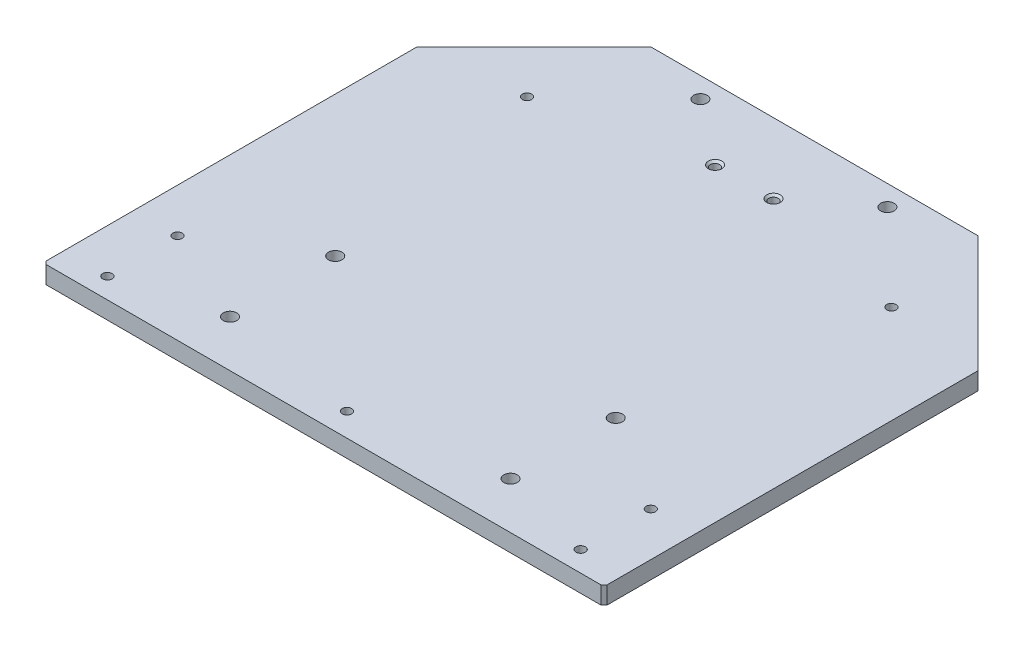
ISO-10303-21;
HEADER;
FILE_DESCRIPTION(('STEP AP214'),'2;1');
FILE_NAME('part.step','',(''),(''),'','','');
FILE_SCHEMA(('AUTOMOTIVE_DESIGN { 1 0 10303 214 1 1 1 1 }'));
ENDSEC;
DATA;
#1=APPLICATION_CONTEXT('core data for automotive mechanical design processes');
#2=APPLICATION_PROTOCOL_DEFINITION('international standard','automotive_design',2000,#1);
#3=PRODUCT_CONTEXT('',#1,'mechanical');
#4=PRODUCT('Part','Part','',(#3));
#5=PRODUCT_RELATED_PRODUCT_CATEGORY('part','',(#4));
#6=PRODUCT_DEFINITION_FORMATION('','',#4);
#7=PRODUCT_DEFINITION_CONTEXT('part definition',#1,'design');
#8=PRODUCT_DEFINITION('design','',#6,#7);
#9=PRODUCT_DEFINITION_SHAPE('','',#8);
#10=(LENGTH_UNIT() NAMED_UNIT(*) SI_UNIT(.MILLI.,.METRE.));
#11=(NAMED_UNIT(*) PLANE_ANGLE_UNIT() SI_UNIT($,.RADIAN.));
#12=(NAMED_UNIT(*) SI_UNIT($,.STERADIAN.) SOLID_ANGLE_UNIT());
#13=UNCERTAINTY_MEASURE_WITH_UNIT(LENGTH_MEASURE(1.E-05),#10,'distance_accuracy_value','');
#14=(GEOMETRIC_REPRESENTATION_CONTEXT(3) GLOBAL_UNCERTAINTY_ASSIGNED_CONTEXT((#13)) GLOBAL_UNIT_ASSIGNED_CONTEXT((#10,
#11,#12)) REPRESENTATION_CONTEXT('',''));
#15=CARTESIAN_POINT('',(0.,0.,0.));
#16=DIRECTION('',(0.,0.,1.));
#17=DIRECTION('',(1.,0.,0.));
#18=AXIS2_PLACEMENT_3D('',#15,#16,#17);
#19=CARTESIAN_POINT('',(0.,0.,0.));
#20=DIRECTION('',(0.,1.,0.));
#21=DIRECTION('',(0.,0.,1.));
#22=AXIS2_PLACEMENT_3D('',#19,#20,#21);
#23=PLANE('',#22);
#24=CARTESIAN_POINT('',(-15.875,0.,-88.3158));
#25=DIRECTION('',(0.,1.,0.));
#26=DIRECTION('',(0.,0.,1.));
#27=AXIS2_PLACEMENT_3D('',#24,#25,#26);
#28=CIRCLE('',#27,2.55269999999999);
#29=CARTESIAN_POINT('',(-15.875,0.,-85.7631));
#30=VERTEX_POINT('',#29);
#31=EDGE_CURVE('E298',#30,#30,#28,.T.);
#32=ORIENTED_EDGE('',*,*,#31,.T.);
#33=EDGE_LOOP('',(#32));
#34=FACE_BOUND('',#33,.T.);
#35=CARTESIAN_POINT('',(15.875,0.,-88.3158));
#36=DIRECTION('',(0.,1.,0.));
#37=DIRECTION('',(0.,0.,1.));
#38=AXIS2_PLACEMENT_3D('',#35,#36,#37);
#39=CIRCLE('',#38,2.55269999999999);
#40=CARTESIAN_POINT('',(15.875,0.,-85.7631));
#41=VERTEX_POINT('',#40);
#42=EDGE_CURVE('E289',#41,#41,#39,.T.);
#43=ORIENTED_EDGE('',*,*,#42,.T.);
#44=EDGE_LOOP('',(#43));
#45=FACE_BOUND('',#44,.T.);
#46=CARTESIAN_POINT('',(-128.5875,0.,129.159));
#47=DIRECTION('',(0.,-1.,0.));
#48=DIRECTION('',(0.,0.,-1.));
#49=AXIS2_PLACEMENT_3D('',#46,#47,#48);
#50=CIRCLE('',#49,3.6576);
#51=CARTESIAN_POINT('',(-128.5875,0.,125.5014));
#52=VERTEX_POINT('',#51);
#53=EDGE_CURVE('E286',#52,#52,#50,.T.);
#54=ORIENTED_EDGE('',*,*,#53,.F.);
#55=EDGE_LOOP('',(#54));
#56=FACE_BOUND('',#55,.T.);
#57=CARTESIAN_POINT('',(-128.5875,0.,91.059));
#58=DIRECTION('',(0.,-1.,0.));
#59=DIRECTION('',(0.,0.,-1.));
#60=AXIS2_PLACEMENT_3D('',#57,#58,#59);
#61=CIRCLE('',#60,3.6576);
#62=CARTESIAN_POINT('',(-128.5875,0.,87.4014));
#63=VERTEX_POINT('',#62);
#64=EDGE_CURVE('E277',#63,#63,#61,.T.);
#65=ORIENTED_EDGE('',*,*,#64,.F.);
#66=EDGE_LOOP('',(#65));
#67=FACE_BOUND('',#66,.T.);
#68=CARTESIAN_POINT('',(128.5748,0.,129.159));
#69=DIRECTION('',(0.,-1.,0.));
#70=DIRECTION('',(0.,0.,-1.));
#71=AXIS2_PLACEMENT_3D('',#68,#69,#70);
#72=CIRCLE('',#71,3.65760000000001);
#73=CARTESIAN_POINT('',(128.5748,0.,125.5014));
#74=VERTEX_POINT('',#73);
#75=EDGE_CURVE('E268',#74,#74,#72,.T.);
#76=ORIENTED_EDGE('',*,*,#75,.F.);
#77=EDGE_LOOP('',(#76));
#78=FACE_BOUND('',#77,.T.);
#79=CARTESIAN_POINT('',(128.5748,0.,91.059));
#80=DIRECTION('',(0.,-1.,0.));
#81=DIRECTION('',(0.,0.,-1.));
#82=AXIS2_PLACEMENT_3D('',#79,#80,#81);
#83=CIRCLE('',#82,3.65760000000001);
#84=CARTESIAN_POINT('',(128.5748,0.,87.4014));
#85=VERTEX_POINT('',#84);
#86=EDGE_CURVE('E259',#85,#85,#83,.T.);
#87=ORIENTED_EDGE('',*,*,#86,.F.);
#88=EDGE_LOOP('',(#87));
#89=FACE_BOUND('',#88,.T.);
#90=CARTESIAN_POINT('',(76.2000000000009,0.,57.7342000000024));
#91=DIRECTION('',(0.,-1.,0.));
#92=DIRECTION('',(0.,0.,-1.));
#93=AXIS2_PLACEMENT_3D('',#90,#91,#92);
#94=CIRCLE('',#93,3.6576);
#95=CARTESIAN_POINT('',(76.2000000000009,0.,54.0766000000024));
#96=VERTEX_POINT('',#95);
#97=EDGE_CURVE('E250',#96,#96,#94,.T.);
#98=ORIENTED_EDGE('',*,*,#97,.F.);
#99=EDGE_LOOP('',(#98));
#100=FACE_BOUND('',#99,.T.);
#101=CARTESIAN_POINT('',(76.2000000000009,0.,114.884199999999));
#102=DIRECTION('',(0.,-1.,0.));
#103=DIRECTION('',(0.,0.,-1.));
#104=AXIS2_PLACEMENT_3D('',#101,#102,#103);
#105=CIRCLE('',#104,3.6576);
#106=CARTESIAN_POINT('',(76.2000000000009,0.,111.226599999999));
#107=VERTEX_POINT('',#106);
#108=EDGE_CURVE('E244',#107,#107,#105,.T.);
#109=ORIENTED_EDGE('',*,*,#108,.F.);
#110=EDGE_LOOP('',(#109));
#111=FACE_BOUND('',#110,.T.);
#112=CARTESIAN_POINT('',(-76.1999999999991,0.,114.884200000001));
#113=DIRECTION('',(0.,-1.,0.));
#114=DIRECTION('',(0.,0.,-1.));
#115=AXIS2_PLACEMENT_3D('',#112,#113,#114);
#116=CIRCLE('',#115,3.6576);
#117=CARTESIAN_POINT('',(-76.1999999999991,0.,111.226600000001));
#118=VERTEX_POINT('',#117);
#119=EDGE_CURVE('E238',#118,#118,#116,.T.);
#120=ORIENTED_EDGE('',*,*,#119,.F.);
#121=EDGE_LOOP('',(#120));
#122=FACE_BOUND('',#121,.T.);
#123=CARTESIAN_POINT('',(-76.1999999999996,0.,57.7342000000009));
#124=DIRECTION('',(0.,-1.,0.));
#125=DIRECTION('',(0.,0.,-1.));
#126=AXIS2_PLACEMENT_3D('',#123,#124,#125);
#127=CIRCLE('',#126,3.6576);
#128=CARTESIAN_POINT('',(-76.1999999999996,0.,54.0766000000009));
#129=VERTEX_POINT('',#128);
#130=EDGE_CURVE('E232',#129,#129,#127,.T.);
#131=ORIENTED_EDGE('',*,*,#130,.F.);
#132=EDGE_LOOP('',(#131));
#133=FACE_BOUND('',#132,.T.);
#134=CARTESIAN_POINT('',(-50.8,0.,-115.2906));
#135=DIRECTION('',(0.,-1.,0.));
#136=DIRECTION('',(0.,0.,-1.));
#137=AXIS2_PLACEMENT_3D('',#134,#135,#136);
#138=CIRCLE('',#137,3.6576);
#139=CARTESIAN_POINT('',(-50.8,0.,-118.9482));
#140=VERTEX_POINT('',#139);
#141=EDGE_CURVE('E226',#140,#140,#138,.T.);
#142=ORIENTED_EDGE('',*,*,#141,.F.);
#143=EDGE_LOOP('',(#142));
#144=FACE_BOUND('',#143,.T.);
#145=CARTESIAN_POINT('',(-99.0092,0.,-69.2658));
#146=DIRECTION('',(0.,1.,0.));
#147=DIRECTION('',(0.,0.,1.));
#148=AXIS2_PLACEMENT_3D('',#145,#146,#147);
#149=CIRCLE('',#148,3.6576);
#150=CARTESIAN_POINT('',(-99.0092,0.,-65.6082000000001));
#151=VERTEX_POINT('',#150);
#152=EDGE_CURVE('E214',#151,#151,#149,.T.);
#153=ORIENTED_EDGE('',*,*,#152,.T.);
#154=EDGE_LOOP('',(#153));
#155=FACE_BOUND('',#154,.T.);
#156=CARTESIAN_POINT('',(99.0092,0.,-69.2658));
#157=DIRECTION('',(0.,1.,0.));
#158=DIRECTION('',(0.,0.,1.));
#159=AXIS2_PLACEMENT_3D('',#156,#157,#158);
#160=CIRCLE('',#159,3.6576);
#161=CARTESIAN_POINT('',(99.0092,0.,-65.6082));
#162=VERTEX_POINT('',#161);
#163=EDGE_CURVE('E205',#162,#162,#160,.T.);
#164=ORIENTED_EDGE('',*,*,#163,.T.);
#165=EDGE_LOOP('',(#164));
#166=FACE_BOUND('',#165,.T.);
#167=CARTESIAN_POINT('',(0.,0.,127.5842));
#168=DIRECTION('',(0.,1.,0.));
#169=DIRECTION('',(0.,0.,1.));
#170=AXIS2_PLACEMENT_3D('',#167,#168,#169);
#171=CIRCLE('',#170,3.6576);
#172=CARTESIAN_POINT('',(0.,0.,131.2418));
#173=VERTEX_POINT('',#172);
#174=EDGE_CURVE('E196',#173,#173,#171,.T.);
#175=ORIENTED_EDGE('',*,*,#174,.T.);
#176=EDGE_LOOP('',(#175));
#177=FACE_BOUND('',#176,.T.);
#178=DIRECTION('',(0.,0.,1.));
#179=VECTOR('',#178,1.);
#180=CARTESIAN_POINT('',(-152.4,0.,140.2842));
#181=LINE('',#180,#179);
#182=CARTESIAN_POINT('',(-152.4,0.,-62.9158));
#183=VERTEX_POINT('',#182);
#184=CARTESIAN_POINT('',(-152.4,0.,138.6967));
#185=VERTEX_POINT('',#184);
#186=EDGE_CURVE('E134',#183,#185,#181,.T.);
#187=ORIENTED_EDGE('',*,*,#186,.F.);
#188=DIRECTION('',(-0.707106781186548,0.,0.707106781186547));
#189=VECTOR('',#188,1.);
#190=CARTESIAN_POINT('',(-152.4,0.,-62.9158));
#191=LINE('',#190,#189);
#192=CARTESIAN_POINT('',(-88.8999999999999,0.,-126.4158));
#193=VERTEX_POINT('',#192);
#194=EDGE_CURVE('E160',#183,#193,#191,.F.);
#195=ORIENTED_EDGE('',*,*,#194,.T.);
#196=DIRECTION('',(-1.,0.,0.));
#197=VECTOR('',#196,1.);
#198=CARTESIAN_POINT('',(152.4,0.,-126.4158));
#199=LINE('',#198,#197);
#200=CARTESIAN_POINT('',(88.9000000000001,0.,-126.4158));
#201=VERTEX_POINT('',#200);
#202=EDGE_CURVE('E136',#201,#193,#199,.T.);
#203=ORIENTED_EDGE('',*,*,#202,.F.);
#204=DIRECTION('',(-0.707106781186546,0.,-0.707106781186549));
#205=VECTOR('',#204,1.);
#206=CARTESIAN_POINT('',(88.9000000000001,0.,-126.4158));
#207=LINE('',#206,#205);
#208=CARTESIAN_POINT('',(152.4,0.,-62.9157999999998));
#209=VERTEX_POINT('',#208);
#210=EDGE_CURVE('E158',#201,#209,#207,.F.);
#211=ORIENTED_EDGE('',*,*,#210,.T.);
#212=DIRECTION('',(0.,0.,-1.));
#213=VECTOR('',#212,1.);
#214=CARTESIAN_POINT('',(152.4,0.,140.2842));
#215=LINE('',#214,#213);
#216=CARTESIAN_POINT('',(152.4,0.,138.6967));
#217=VERTEX_POINT('',#216);
#218=EDGE_CURVE('E133',#217,#209,#215,.T.);
#219=ORIENTED_EDGE('',*,*,#218,.F.);
#220=DIRECTION('',(0.707106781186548,0.,-0.707106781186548));
#221=VECTOR('',#220,1.);
#222=CARTESIAN_POINT('',(152.4,0.,138.6967));
#223=LINE('',#222,#221);
#224=CARTESIAN_POINT('',(150.8125,0.,140.2842));
#225=VERTEX_POINT('',#224);
#226=EDGE_CURVE('E119',#217,#225,#223,.F.);
#227=ORIENTED_EDGE('',*,*,#226,.T.);
#228=DIRECTION('',(1.,0.,0.));
#229=VECTOR('',#228,1.);
#230=CARTESIAN_POINT('',(152.4,0.,140.2842));
#231=LINE('',#230,#229);
#232=CARTESIAN_POINT('',(-150.8125,0.,140.2842));
#233=VERTEX_POINT('',#232);
#234=EDGE_CURVE('E125',#233,#225,#231,.T.);
#235=ORIENTED_EDGE('',*,*,#234,.F.);
#236=DIRECTION('',(0.70710678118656,0.,0.707106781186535));
#237=VECTOR('',#236,1.);
#238=CARTESIAN_POINT('',(-150.8125,0.,140.2842));
#239=LINE('',#238,#237);
#240=EDGE_CURVE('E109',#233,#185,#239,.F.);
#241=ORIENTED_EDGE('',*,*,#240,.T.);
#242=EDGE_LOOP('',(#187,#195,#203,#211,#219,#227,#235,#241));
#243=FACE_BOUND('',#242,.T.);
#244=CARTESIAN_POINT('',(50.8,0.,-115.2906));
#245=DIRECTION('',(0.,-1.,0.));
#246=DIRECTION('',(0.,0.,-1.));
#247=AXIS2_PLACEMENT_3D('',#244,#245,#246);
#248=CIRCLE('',#247,3.6576);
#249=CARTESIAN_POINT('',(50.8,0.,-118.9482));
#250=VERTEX_POINT('',#249);
#251=EDGE_CURVE('E220',#250,#250,#248,.T.);
#252=ORIENTED_EDGE('',*,*,#251,.F.);
#253=EDGE_LOOP('',(#252));
#254=FACE_BOUND('',#253,.T.);
#255=ADVANCED_FACE('F41',(#34,#45,#56,#67,#78,#89,#100,#111,#122,#133,#144,#155,#166,#177,#243,
#254),#23,.F.);
#256=CARTESIAN_POINT('',(-152.4,9.525,140.2842));
#257=DIRECTION('',(1.,0.,0.));
#258=DIRECTION('',(0.,0.,-1.));
#259=AXIS2_PLACEMENT_3D('',#256,#257,#258);
#260=PLANE('',#259);
#261=DIRECTION('',(0.,0.,1.));
#262=VECTOR('',#261,1.);
#263=CARTESIAN_POINT('',(-152.4,9.525,140.2842));
#264=LINE('',#263,#262);
#265=CARTESIAN_POINT('',(-152.4,9.525,-62.9158));
#266=VERTEX_POINT('',#265);
#267=CARTESIAN_POINT('',(-152.4,9.525,138.6967));
#268=VERTEX_POINT('',#267);
#269=EDGE_CURVE('E143',#266,#268,#264,.T.);
#270=ORIENTED_EDGE('',*,*,#269,.F.);
#271=DIRECTION('',(0.,-1.,0.));
#272=VECTOR('',#271,1.);
#273=CARTESIAN_POINT('',(-152.4,9.525,-62.9158));
#274=LINE('',#273,#272);
#275=EDGE_CURVE('E155',#266,#183,#274,.T.);
#276=ORIENTED_EDGE('',*,*,#275,.T.);
#277=ORIENTED_EDGE('',*,*,#186,.T.);
#278=DIRECTION('',(0.,1.,0.));
#279=VECTOR('',#278,1.);
#280=CARTESIAN_POINT('',(-152.4,9.525,138.6967));
#281=LINE('',#280,#279);
#282=EDGE_CURVE('E115',#185,#268,#281,.T.);
#283=ORIENTED_EDGE('',*,*,#282,.T.);
#284=EDGE_LOOP('',(#270,#276,#277,#283));
#285=FACE_BOUND('',#284,.T.);
#286=ADVANCED_FACE('F174',(#285),#260,.F.);
#287=CARTESIAN_POINT('',(152.4,9.525,140.2842));
#288=DIRECTION('',(0.,0.,-1.));
#289=DIRECTION('',(-1.,0.,0.));
#290=AXIS2_PLACEMENT_3D('',#287,#288,#289);
#291=PLANE('',#290);
#292=DIRECTION('',(1.,0.,0.));
#293=VECTOR('',#292,1.);
#294=CARTESIAN_POINT('',(152.4,9.525,140.2842));
#295=LINE('',#294,#293);
#296=CARTESIAN_POINT('',(-150.8125,9.525,140.2842));
#297=VERTEX_POINT('',#296);
#298=CARTESIAN_POINT('',(150.8125,9.525,140.2842));
#299=VERTEX_POINT('',#298);
#300=EDGE_CURVE('E128',#297,#299,#295,.T.);
#301=ORIENTED_EDGE('',*,*,#300,.F.);
#302=DIRECTION('',(0.,-1.,0.));
#303=VECTOR('',#302,1.);
#304=CARTESIAN_POINT('',(-150.8125,9.525,140.2842));
#305=LINE('',#304,#303);
#306=EDGE_CURVE('E113',#297,#233,#305,.T.);
#307=ORIENTED_EDGE('',*,*,#306,.T.);
#308=ORIENTED_EDGE('',*,*,#234,.T.);
#309=DIRECTION('',(0.,1.,0.));
#310=VECTOR('',#309,1.);
#311=CARTESIAN_POINT('',(150.8125,9.525,140.2842));
#312=LINE('',#311,#310);
#313=EDGE_CURVE('E129',#225,#299,#312,.T.);
#314=ORIENTED_EDGE('',*,*,#313,.T.);
#315=EDGE_LOOP('',(#301,#307,#308,#314));
#316=FACE_BOUND('',#315,.T.);
#317=ADVANCED_FACE('F124',(#316),#291,.F.);
#318=CARTESIAN_POINT('',(152.4,9.525,140.2842));
#319=DIRECTION('',(-1.,0.,0.));
#320=DIRECTION('',(0.,0.,1.));
#321=AXIS2_PLACEMENT_3D('',#318,#319,#320);
#322=PLANE('',#321);
#323=ORIENTED_EDGE('',*,*,#218,.T.);
#324=DIRECTION('',(0.,1.,0.));
#325=VECTOR('',#324,1.);
#326=CARTESIAN_POINT('',(152.4,9.525,-62.9157999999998));
#327=LINE('',#326,#325);
#328=CARTESIAN_POINT('',(152.4,9.525,-62.9157999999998));
#329=VERTEX_POINT('',#328);
#330=EDGE_CURVE('E11',#209,#329,#327,.T.);
#331=ORIENTED_EDGE('',*,*,#330,.T.);
#332=DIRECTION('',(0.,0.,-1.));
#333=VECTOR('',#332,1.);
#334=CARTESIAN_POINT('',(152.4,9.525,140.2842));
#335=LINE('',#334,#333);
#336=CARTESIAN_POINT('',(152.4,9.525,138.6967));
#337=VERTEX_POINT('',#336);
#338=EDGE_CURVE('E184',#337,#329,#335,.T.);
#339=ORIENTED_EDGE('',*,*,#338,.F.);
#340=DIRECTION('',(0.,-1.,0.));
#341=VECTOR('',#340,1.);
#342=CARTESIAN_POINT('',(152.4,9.525,138.6967));
#343=LINE('',#342,#341);
#344=EDGE_CURVE('E152',#337,#217,#343,.T.);
#345=ORIENTED_EDGE('',*,*,#344,.T.);
#346=EDGE_LOOP('',(#323,#331,#339,#345));
#347=FACE_BOUND('',#346,.T.);
#348=ADVANCED_FACE('F182',(#347),#322,.F.);
#349=CARTESIAN_POINT('',(152.4,9.525,-126.4158));
#350=DIRECTION('',(0.,0.,1.));
#351=DIRECTION('',(1.,0.,0.));
#352=AXIS2_PLACEMENT_3D('',#349,#350,#351);
#353=PLANE('',#352);
#354=ORIENTED_EDGE('',*,*,#202,.T.);
#355=DIRECTION('',(0.,1.,0.));
#356=VECTOR('',#355,1.);
#357=CARTESIAN_POINT('',(-88.8999999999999,9.525,-126.4158));
#358=LINE('',#357,#356);
#359=CARTESIAN_POINT('',(-88.8999999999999,9.525,-126.4158));
#360=VERTEX_POINT('',#359);
#361=EDGE_CURVE('E62',#193,#360,#358,.T.);
#362=ORIENTED_EDGE('',*,*,#361,.T.);
#363=DIRECTION('',(-1.,0.,0.));
#364=VECTOR('',#363,1.);
#365=CARTESIAN_POINT('',(152.4,9.525,-126.4158));
#366=LINE('',#365,#364);
#367=CARTESIAN_POINT('',(88.9000000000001,9.525,-126.4158));
#368=VERTEX_POINT('',#367);
#369=EDGE_CURVE('E144',#368,#360,#366,.T.);
#370=ORIENTED_EDGE('',*,*,#369,.F.);
#371=DIRECTION('',(0.,-1.,0.));
#372=VECTOR('',#371,1.);
#373=CARTESIAN_POINT('',(88.9000000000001,9.525,-126.4158));
#374=LINE('',#373,#372);
#375=EDGE_CURVE('E162',#368,#201,#374,.T.);
#376=ORIENTED_EDGE('',*,*,#375,.T.);
#377=EDGE_LOOP('',(#354,#362,#370,#376));
#378=FACE_BOUND('',#377,.T.);
#379=ADVANCED_FACE('F178',(#378),#353,.F.);
#380=CARTESIAN_POINT('',(0.,9.525,0.));
#381=DIRECTION('',(0.,1.,0.));
#382=DIRECTION('',(0.,0.,1.));
#383=AXIS2_PLACEMENT_3D('',#380,#381,#382);
#384=PLANE('',#383);
#385=CARTESIAN_POINT('',(-15.875,9.525,-88.3158));
#386=DIRECTION('',(0.,1.,0.));
#387=DIRECTION('',(0.,0.,1.));
#388=AXIS2_PLACEMENT_3D('',#385,#386,#387);
#389=CIRCLE('',#388,3.6576);
#390=CARTESIAN_POINT('',(-15.875,9.525,-84.6582));
#391=VERTEX_POINT('',#390);
#392=EDGE_CURVE('E304',#391,#391,#389,.T.);
#393=ORIENTED_EDGE('',*,*,#392,.F.);
#394=EDGE_LOOP('',(#393));
#395=FACE_BOUND('',#394,.T.);
#396=CARTESIAN_POINT('',(15.875,9.525,-88.3158));
#397=DIRECTION('',(0.,1.,0.));
#398=DIRECTION('',(0.,0.,1.));
#399=AXIS2_PLACEMENT_3D('',#396,#397,#398);
#400=CIRCLE('',#399,3.6576);
#401=CARTESIAN_POINT('',(15.875,9.525,-84.6582));
#402=VERTEX_POINT('',#401);
#403=EDGE_CURVE('E295',#402,#402,#400,.T.);
#404=ORIENTED_EDGE('',*,*,#403,.F.);
#405=EDGE_LOOP('',(#404));
#406=FACE_BOUND('',#405,.T.);
#407=CARTESIAN_POINT('',(-128.5875,9.52500000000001,129.159));
#408=DIRECTION('',(0.,-1.,0.));
#409=DIRECTION('',(0.,0.,-1.));
#410=AXIS2_PLACEMENT_3D('',#407,#408,#409);
#411=CIRCLE('',#410,2.55269999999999);
#412=CARTESIAN_POINT('',(-128.5875,9.52500000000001,126.6063));
#413=VERTEX_POINT('',#412);
#414=EDGE_CURVE('E280',#413,#413,#411,.T.);
#415=ORIENTED_EDGE('',*,*,#414,.T.);
#416=EDGE_LOOP('',(#415));
#417=FACE_BOUND('',#416,.T.);
#418=CARTESIAN_POINT('',(-128.5875,9.52500000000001,91.059));
#419=DIRECTION('',(0.,-1.,0.));
#420=DIRECTION('',(0.,0.,-1.));
#421=AXIS2_PLACEMENT_3D('',#418,#419,#420);
#422=CIRCLE('',#421,2.55269999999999);
#423=CARTESIAN_POINT('',(-128.5875,9.52500000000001,88.5063));
#424=VERTEX_POINT('',#423);
#425=EDGE_CURVE('E271',#424,#424,#422,.T.);
#426=ORIENTED_EDGE('',*,*,#425,.T.);
#427=EDGE_LOOP('',(#426));
#428=FACE_BOUND('',#427,.T.);
#429=CARTESIAN_POINT('',(128.5748,9.52500000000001,129.159));
#430=DIRECTION('',(0.,-1.,0.));
#431=DIRECTION('',(0.,0.,-1.));
#432=AXIS2_PLACEMENT_3D('',#429,#430,#431);
#433=CIRCLE('',#432,2.55269999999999);
#434=CARTESIAN_POINT('',(128.5748,9.52500000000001,126.6063));
#435=VERTEX_POINT('',#434);
#436=EDGE_CURVE('E262',#435,#435,#433,.T.);
#437=ORIENTED_EDGE('',*,*,#436,.T.);
#438=EDGE_LOOP('',(#437));
#439=FACE_BOUND('',#438,.T.);
#440=CARTESIAN_POINT('',(128.5748,9.52500000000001,91.059));
#441=DIRECTION('',(0.,-1.,0.));
#442=DIRECTION('',(0.,0.,-1.));
#443=AXIS2_PLACEMENT_3D('',#440,#441,#442);
#444=CIRCLE('',#443,2.55269999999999);
#445=CARTESIAN_POINT('',(128.5748,9.52500000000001,88.5063));
#446=VERTEX_POINT('',#445);
#447=EDGE_CURVE('E253',#446,#446,#444,.T.);
#448=ORIENTED_EDGE('',*,*,#447,.T.);
#449=EDGE_LOOP('',(#448));
#450=FACE_BOUND('',#449,.T.);
#451=CARTESIAN_POINT('',(76.2000000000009,9.525,57.7342000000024));
#452=DIRECTION('',(0.,-1.,0.));
#453=DIRECTION('',(0.,0.,-1.));
#454=AXIS2_PLACEMENT_3D('',#451,#452,#453);
#455=CIRCLE('',#454,3.6576);
#456=CARTESIAN_POINT('',(76.2000000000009,9.525,54.0766000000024));
#457=VERTEX_POINT('',#456);
#458=EDGE_CURVE('E247',#457,#457,#455,.T.);
#459=ORIENTED_EDGE('',*,*,#458,.T.);
#460=EDGE_LOOP('',(#459));
#461=FACE_BOUND('',#460,.T.);
#462=CARTESIAN_POINT('',(76.2000000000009,9.525,114.884199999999));
#463=DIRECTION('',(0.,-1.,0.));
#464=DIRECTION('',(0.,0.,-1.));
#465=AXIS2_PLACEMENT_3D('',#462,#463,#464);
#466=CIRCLE('',#465,3.6576);
#467=CARTESIAN_POINT('',(76.2000000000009,9.525,111.226599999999));
#468=VERTEX_POINT('',#467);
#469=EDGE_CURVE('E241',#468,#468,#466,.T.);
#470=ORIENTED_EDGE('',*,*,#469,.T.);
#471=EDGE_LOOP('',(#470));
#472=FACE_BOUND('',#471,.T.);
#473=CARTESIAN_POINT('',(-76.1999999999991,9.525,114.884200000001));
#474=DIRECTION('',(0.,-1.,0.));
#475=DIRECTION('',(0.,0.,-1.));
#476=AXIS2_PLACEMENT_3D('',#473,#474,#475);
#477=CIRCLE('',#476,3.6576);
#478=CARTESIAN_POINT('',(-76.1999999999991,9.525,111.226600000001));
#479=VERTEX_POINT('',#478);
#480=EDGE_CURVE('E235',#479,#479,#477,.T.);
#481=ORIENTED_EDGE('',*,*,#480,.T.);
#482=EDGE_LOOP('',(#481));
#483=FACE_BOUND('',#482,.T.);
#484=CARTESIAN_POINT('',(-76.1999999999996,9.525,57.7342000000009));
#485=DIRECTION('',(0.,-1.,0.));
#486=DIRECTION('',(0.,0.,-1.));
#487=AXIS2_PLACEMENT_3D('',#484,#485,#486);
#488=CIRCLE('',#487,3.6576);
#489=CARTESIAN_POINT('',(-76.1999999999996,9.525,54.0766000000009));
#490=VERTEX_POINT('',#489);
#491=EDGE_CURVE('E229',#490,#490,#488,.T.);
#492=ORIENTED_EDGE('',*,*,#491,.T.);
#493=EDGE_LOOP('',(#492));
#494=FACE_BOUND('',#493,.T.);
#495=CARTESIAN_POINT('',(-50.8,9.525,-115.2906));
#496=DIRECTION('',(0.,1.,0.));
#497=DIRECTION('',(0.,0.,1.));
#498=AXIS2_PLACEMENT_3D('',#495,#496,#497);
#499=CIRCLE('',#498,3.6576);
#500=CARTESIAN_POINT('',(-50.8,9.525,-111.633));
#501=VERTEX_POINT('',#500);
#502=EDGE_CURVE('E223',#501,#501,#499,.T.);
#503=ORIENTED_EDGE('',*,*,#502,.F.);
#504=EDGE_LOOP('',(#503));
#505=FACE_BOUND('',#504,.T.);
#506=CARTESIAN_POINT('',(50.8,9.525,-115.2906));
#507=DIRECTION('',(0.,1.,0.));
#508=DIRECTION('',(0.,0.,1.));
#509=AXIS2_PLACEMENT_3D('',#506,#507,#508);
#510=CIRCLE('',#509,3.6576);
#511=CARTESIAN_POINT('',(50.8,9.525,-111.633));
#512=VERTEX_POINT('',#511);
#513=EDGE_CURVE('E217',#512,#512,#510,.T.);
#514=ORIENTED_EDGE('',*,*,#513,.F.);
#515=EDGE_LOOP('',(#514));
#516=FACE_BOUND('',#515,.T.);
#517=CARTESIAN_POINT('',(-99.0092,9.525,-69.2658));
#518=DIRECTION('',(0.,1.,0.));
#519=DIRECTION('',(0.,0.,1.));
#520=AXIS2_PLACEMENT_3D('',#517,#518,#519);
#521=CIRCLE('',#520,2.55269999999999);
#522=CARTESIAN_POINT('',(-99.0092,9.525,-66.7131000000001));
#523=VERTEX_POINT('',#522);
#524=EDGE_CURVE('E211',#523,#523,#521,.T.);
#525=ORIENTED_EDGE('',*,*,#524,.F.);
#526=EDGE_LOOP('',(#525));
#527=FACE_BOUND('',#526,.T.);
#528=CARTESIAN_POINT('',(99.0092,9.525,-69.2658));
#529=DIRECTION('',(0.,1.,0.));
#530=DIRECTION('',(0.,0.,1.));
#531=AXIS2_PLACEMENT_3D('',#528,#529,#530);
#532=CIRCLE('',#531,2.55269999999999);
#533=CARTESIAN_POINT('',(99.0092,9.525,-66.7131));
#534=VERTEX_POINT('',#533);
#535=EDGE_CURVE('E202',#534,#534,#532,.T.);
#536=ORIENTED_EDGE('',*,*,#535,.F.);
#537=EDGE_LOOP('',(#536));
#538=FACE_BOUND('',#537,.T.);
#539=CARTESIAN_POINT('',(0.,9.525,127.5842));
#540=DIRECTION('',(0.,1.,0.));
#541=DIRECTION('',(0.,0.,1.));
#542=AXIS2_PLACEMENT_3D('',#539,#540,#541);
#543=CIRCLE('',#542,2.55269999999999);
#544=CARTESIAN_POINT('',(0.,9.525,130.1369));
#545=VERTEX_POINT('',#544);
#546=EDGE_CURVE('E193',#545,#545,#543,.T.);
#547=ORIENTED_EDGE('',*,*,#546,.F.);
#548=EDGE_LOOP('',(#547));
#549=FACE_BOUND('',#548,.T.);
#550=ORIENTED_EDGE('',*,*,#369,.T.);
#551=DIRECTION('',(0.707106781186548,0.,-0.707106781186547));
#552=VECTOR('',#551,1.);
#553=CARTESIAN_POINT('',(-107.6579,9.525,-107.6579));
#554=LINE('',#553,#552);
#555=EDGE_CURVE('E49',#360,#266,#554,.F.);
#556=ORIENTED_EDGE('',*,*,#555,.T.);
#557=ORIENTED_EDGE('',*,*,#269,.T.);
#558=DIRECTION('',(-0.70710678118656,0.,-0.707106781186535));
#559=VECTOR('',#558,1.);
#560=CARTESIAN_POINT('',(-145.548349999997,9.525,145.548350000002));
#561=LINE('',#560,#559);
#562=EDGE_CURVE('E150',#268,#297,#561,.F.);
#563=ORIENTED_EDGE('',*,*,#562,.T.);
#564=ORIENTED_EDGE('',*,*,#300,.T.);
#565=DIRECTION('',(-0.707106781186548,0.,0.707106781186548));
#566=VECTOR('',#565,1.);
#567=CARTESIAN_POINT('',(145.54835,9.525,145.54835));
#568=LINE('',#567,#566);
#569=EDGE_CURVE('E148',#299,#337,#568,.F.);
#570=ORIENTED_EDGE('',*,*,#569,.T.);
#571=ORIENTED_EDGE('',*,*,#338,.T.);
#572=DIRECTION('',(0.707106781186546,0.,0.707106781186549));
#573=VECTOR('',#572,1.);
#574=CARTESIAN_POINT('',(107.6579,9.525,-107.6579));
#575=LINE('',#574,#573);
#576=EDGE_CURVE('E166',#329,#368,#575,.F.);
#577=ORIENTED_EDGE('',*,*,#576,.T.);
#578=EDGE_LOOP('',(#550,#556,#557,#563,#564,#570,#571,#577));
#579=FACE_BOUND('',#578,.T.);
#580=ADVANCED_FACE('F170',(#395,#406,#417,#428,#439,#450,#461,#472,#483,#494,#505,#516,#527,
#538,#549,#579),#384,.T.);
#581=CARTESIAN_POINT('',(0.,1.1049,127.5842));
#582=DIRECTION('',(0.,-1.,0.));
#583=DIRECTION('',(0.,0.,-1.));
#584=AXIS2_PLACEMENT_3D('',#581,#582,#583);
#585=CONICAL_SURFACE('',#584,2.5527,0.785398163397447);
#586=ORIENTED_EDGE('',*,*,#174,.F.);
#587=EDGE_LOOP('',(#586));
#588=FACE_BOUND('',#587,.T.);
#589=CARTESIAN_POINT('',(0.,1.1049,127.5842));
#590=DIRECTION('',(0.,1.,0.));
#591=DIRECTION('',(0.,0.,1.));
#592=AXIS2_PLACEMENT_3D('',#589,#590,#591);
#593=CIRCLE('',#592,2.5527);
#594=CARTESIAN_POINT('',(0.,1.1049,130.1369));
#595=VERTEX_POINT('',#594);
#596=EDGE_CURVE('E138',#595,#595,#593,.T.);
#597=ORIENTED_EDGE('',*,*,#596,.T.);
#598=EDGE_LOOP('',(#597));
#599=FACE_BOUND('',#598,.T.);
#600=ADVANCED_FACE('F312',(#588,#599),#585,.F.);
#601=CARTESIAN_POINT('',(0.,9.525,127.5842));
#602=DIRECTION('',(0.,1.,0.));
#603=DIRECTION('',(0.,0.,1.));
#604=AXIS2_PLACEMENT_3D('',#601,#602,#603);
#605=CYLINDRICAL_SURFACE('',#604,2.55269999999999);
#606=ORIENTED_EDGE('',*,*,#596,.F.);
#607=EDGE_LOOP('',(#606));
#608=FACE_BOUND('',#607,.T.);
#609=ORIENTED_EDGE('',*,*,#546,.T.);
#610=EDGE_LOOP('',(#609));
#611=FACE_BOUND('',#610,.T.);
#612=ADVANCED_FACE('F342',(#608,#611),#605,.F.);
#613=CARTESIAN_POINT('',(99.0092,1.1049,-69.2658));
#614=DIRECTION('',(0.,-1.,0.));
#615=DIRECTION('',(0.,0.,-1.));
#616=AXIS2_PLACEMENT_3D('',#613,#614,#615);
#617=CONICAL_SURFACE('',#616,2.55269999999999,0.785398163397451);
#618=ORIENTED_EDGE('',*,*,#163,.F.);
#619=EDGE_LOOP('',(#618));
#620=FACE_BOUND('',#619,.T.);
#621=CARTESIAN_POINT('',(99.0092,1.1049,-69.2658));
#622=DIRECTION('',(0.,1.,0.));
#623=DIRECTION('',(0.,0.,1.));
#624=AXIS2_PLACEMENT_3D('',#621,#622,#623);
#625=CIRCLE('',#624,2.55269999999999);
#626=CARTESIAN_POINT('',(99.0092,1.1049,-66.7131));
#627=VERTEX_POINT('',#626);
#628=EDGE_CURVE('E199',#627,#627,#625,.T.);
#629=ORIENTED_EDGE('',*,*,#628,.T.);
#630=EDGE_LOOP('',(#629));
#631=FACE_BOUND('',#630,.T.);
#632=ADVANCED_FACE('F344',(#620,#631),#617,.F.);
#633=CARTESIAN_POINT('',(99.0092,9.525,-69.2658));
#634=DIRECTION('',(0.,1.,0.));
#635=DIRECTION('',(0.,0.,1.));
#636=AXIS2_PLACEMENT_3D('',#633,#634,#635);
#637=CYLINDRICAL_SURFACE('',#636,2.55269999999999);
#638=ORIENTED_EDGE('',*,*,#628,.F.);
#639=EDGE_LOOP('',(#638));
#640=FACE_BOUND('',#639,.T.);
#641=ORIENTED_EDGE('',*,*,#535,.T.);
#642=EDGE_LOOP('',(#641));
#643=FACE_BOUND('',#642,.T.);
#644=ADVANCED_FACE('F351',(#640,#643),#637,.F.);
#645=CARTESIAN_POINT('',(-99.0092,1.1049,-69.2658));
#646=DIRECTION('',(0.,-1.,0.));
#647=DIRECTION('',(0.,0.,-1.));
#648=AXIS2_PLACEMENT_3D('',#645,#646,#647);
#649=CONICAL_SURFACE('',#648,2.55269999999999,0.785398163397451);
#650=ORIENTED_EDGE('',*,*,#152,.F.);
#651=EDGE_LOOP('',(#650));
#652=FACE_BOUND('',#651,.T.);
#653=CARTESIAN_POINT('',(-99.0092,1.1049,-69.2658));
#654=DIRECTION('',(0.,1.,0.));
#655=DIRECTION('',(0.,0.,1.));
#656=AXIS2_PLACEMENT_3D('',#653,#654,#655);
#657=CIRCLE('',#656,2.55269999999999);
#658=CARTESIAN_POINT('',(-99.0092,1.1049,-66.7131000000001));
#659=VERTEX_POINT('',#658);
#660=EDGE_CURVE('E208',#659,#659,#657,.T.);
#661=ORIENTED_EDGE('',*,*,#660,.T.);
#662=EDGE_LOOP('',(#661));
#663=FACE_BOUND('',#662,.T.);
#664=ADVANCED_FACE('F455',(#652,#663),#649,.F.);
#665=CARTESIAN_POINT('',(-99.0092,9.525,-69.2658));
#666=DIRECTION('',(0.,1.,0.));
#667=DIRECTION('',(0.,0.,1.));
#668=AXIS2_PLACEMENT_3D('',#665,#666,#667);
#669=CYLINDRICAL_SURFACE('',#668,2.55269999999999);
#670=ORIENTED_EDGE('',*,*,#660,.F.);
#671=EDGE_LOOP('',(#670));
#672=FACE_BOUND('',#671,.T.);
#673=ORIENTED_EDGE('',*,*,#524,.T.);
#674=EDGE_LOOP('',(#673));
#675=FACE_BOUND('',#674,.T.);
#676=ADVANCED_FACE('F451',(#672,#675),#669,.F.);
#677=CARTESIAN_POINT('',(50.8,0.,-115.2906));
#678=DIRECTION('',(0.,-1.,0.));
#679=DIRECTION('',(0.,0.,-1.));
#680=AXIS2_PLACEMENT_3D('',#677,#678,#679);
#681=CYLINDRICAL_SURFACE('',#680,3.6576);
#682=ORIENTED_EDGE('',*,*,#251,.T.);
#683=EDGE_LOOP('',(#682));
#684=FACE_BOUND('',#683,.T.);
#685=ORIENTED_EDGE('',*,*,#513,.T.);
#686=EDGE_LOOP('',(#685));
#687=FACE_BOUND('',#686,.T.);
#688=ADVANCED_FACE('F447',(#684,#687),#681,.F.);
#689=CARTESIAN_POINT('',(-50.8,0.,-115.2906));
#690=DIRECTION('',(0.,-1.,0.));
#691=DIRECTION('',(0.,0.,-1.));
#692=AXIS2_PLACEMENT_3D('',#689,#690,#691);
#693=CYLINDRICAL_SURFACE('',#692,3.6576);
#694=ORIENTED_EDGE('',*,*,#141,.T.);
#695=EDGE_LOOP('',(#694));
#696=FACE_BOUND('',#695,.T.);
#697=ORIENTED_EDGE('',*,*,#502,.T.);
#698=EDGE_LOOP('',(#697));
#699=FACE_BOUND('',#698,.T.);
#700=ADVANCED_FACE('F443',(#696,#699),#693,.F.);
#701=CARTESIAN_POINT('',(-76.1999999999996,0.,57.7342000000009));
#702=DIRECTION('',(0.,-1.,0.));
#703=DIRECTION('',(0.,0.,-1.));
#704=AXIS2_PLACEMENT_3D('',#701,#702,#703);
#705=CYLINDRICAL_SURFACE('',#704,3.6576);
#706=ORIENTED_EDGE('',*,*,#491,.F.);
#707=EDGE_LOOP('',(#706));
#708=FACE_BOUND('',#707,.T.);
#709=ORIENTED_EDGE('',*,*,#130,.T.);
#710=EDGE_LOOP('',(#709));
#711=FACE_BOUND('',#710,.T.);
#712=ADVANCED_FACE('F439',(#708,#711),#705,.F.);
#713=CARTESIAN_POINT('',(-76.1999999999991,0.,114.884200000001));
#714=DIRECTION('',(0.,-1.,0.));
#715=DIRECTION('',(0.,0.,-1.));
#716=AXIS2_PLACEMENT_3D('',#713,#714,#715);
#717=CYLINDRICAL_SURFACE('',#716,3.6576);
#718=ORIENTED_EDGE('',*,*,#480,.F.);
#719=EDGE_LOOP('',(#718));
#720=FACE_BOUND('',#719,.T.);
#721=ORIENTED_EDGE('',*,*,#119,.T.);
#722=EDGE_LOOP('',(#721));
#723=FACE_BOUND('',#722,.T.);
#724=ADVANCED_FACE('F435',(#720,#723),#717,.F.);
#725=CARTESIAN_POINT('',(76.2000000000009,0.,114.884199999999));
#726=DIRECTION('',(0.,-1.,0.));
#727=DIRECTION('',(0.,0.,-1.));
#728=AXIS2_PLACEMENT_3D('',#725,#726,#727);
#729=CYLINDRICAL_SURFACE('',#728,3.6576);
#730=ORIENTED_EDGE('',*,*,#469,.F.);
#731=EDGE_LOOP('',(#730));
#732=FACE_BOUND('',#731,.T.);
#733=ORIENTED_EDGE('',*,*,#108,.T.);
#734=EDGE_LOOP('',(#733));
#735=FACE_BOUND('',#734,.T.);
#736=ADVANCED_FACE('F431',(#732,#735),#729,.F.);
#737=CARTESIAN_POINT('',(76.2000000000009,0.,57.7342000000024));
#738=DIRECTION('',(0.,-1.,0.));
#739=DIRECTION('',(0.,0.,-1.));
#740=AXIS2_PLACEMENT_3D('',#737,#738,#739);
#741=CYLINDRICAL_SURFACE('',#740,3.6576);
#742=ORIENTED_EDGE('',*,*,#458,.F.);
#743=EDGE_LOOP('',(#742));
#744=FACE_BOUND('',#743,.T.);
#745=ORIENTED_EDGE('',*,*,#97,.T.);
#746=EDGE_LOOP('',(#745));
#747=FACE_BOUND('',#746,.T.);
#748=ADVANCED_FACE('F427',(#744,#747),#741,.F.);
#749=CARTESIAN_POINT('',(128.5748,0.,91.059));
#750=DIRECTION('',(0.,-1.,0.));
#751=DIRECTION('',(0.,0.,-1.));
#752=AXIS2_PLACEMENT_3D('',#749,#750,#751);
#753=CYLINDRICAL_SURFACE('',#752,2.55269999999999);
#754=ORIENTED_EDGE('',*,*,#447,.F.);
#755=EDGE_LOOP('',(#754));
#756=FACE_BOUND('',#755,.T.);
#757=CARTESIAN_POINT('',(128.5748,1.1049,91.059));
#758=DIRECTION('',(0.,-1.,0.));
#759=DIRECTION('',(0.,0.,-1.));
#760=AXIS2_PLACEMENT_3D('',#757,#758,#759);
#761=CIRCLE('',#760,2.55269999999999);
#762=CARTESIAN_POINT('',(128.5748,1.1049,88.5063));
#763=VERTEX_POINT('',#762);
#764=EDGE_CURVE('E256',#763,#763,#761,.T.);
#765=ORIENTED_EDGE('',*,*,#764,.T.);
#766=EDGE_LOOP('',(#765));
#767=FACE_BOUND('',#766,.T.);
#768=ADVANCED_FACE('F423',(#756,#767),#753,.F.);
#769=CARTESIAN_POINT('',(128.5748,0.,91.059));
#770=DIRECTION('',(0.,-1.,0.));
#771=DIRECTION('',(0.,0.,-1.));
#772=AXIS2_PLACEMENT_3D('',#769,#770,#771);
#773=CONICAL_SURFACE('',#772,3.65760000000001,0.785398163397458);
#774=ORIENTED_EDGE('',*,*,#764,.F.);
#775=EDGE_LOOP('',(#774));
#776=FACE_BOUND('',#775,.T.);
#777=ORIENTED_EDGE('',*,*,#86,.T.);
#778=EDGE_LOOP('',(#777));
#779=FACE_BOUND('',#778,.T.);
#780=ADVANCED_FACE('F419',(#776,#779),#773,.F.);
#781=CARTESIAN_POINT('',(128.5748,0.,129.159));
#782=DIRECTION('',(0.,-1.,0.));
#783=DIRECTION('',(0.,0.,-1.));
#784=AXIS2_PLACEMENT_3D('',#781,#782,#783);
#785=CYLINDRICAL_SURFACE('',#784,2.55269999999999);
#786=ORIENTED_EDGE('',*,*,#436,.F.);
#787=EDGE_LOOP('',(#786));
#788=FACE_BOUND('',#787,.T.);
#789=CARTESIAN_POINT('',(128.5748,1.1049,129.159));
#790=DIRECTION('',(0.,-1.,0.));
#791=DIRECTION('',(0.,0.,-1.));
#792=AXIS2_PLACEMENT_3D('',#789,#790,#791);
#793=CIRCLE('',#792,2.55269999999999);
#794=CARTESIAN_POINT('',(128.5748,1.1049,126.6063));
#795=VERTEX_POINT('',#794);
#796=EDGE_CURVE('E265',#795,#795,#793,.T.);
#797=ORIENTED_EDGE('',*,*,#796,.T.);
#798=EDGE_LOOP('',(#797));
#799=FACE_BOUND('',#798,.T.);
#800=ADVANCED_FACE('F415',(#788,#799),#785,.F.);
#801=CARTESIAN_POINT('',(128.5748,0.,129.159));
#802=DIRECTION('',(0.,-1.,0.));
#803=DIRECTION('',(0.,0.,-1.));
#804=AXIS2_PLACEMENT_3D('',#801,#802,#803);
#805=CONICAL_SURFACE('',#804,3.65760000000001,0.785398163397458);
#806=ORIENTED_EDGE('',*,*,#796,.F.);
#807=EDGE_LOOP('',(#806));
#808=FACE_BOUND('',#807,.T.);
#809=ORIENTED_EDGE('',*,*,#75,.T.);
#810=EDGE_LOOP('',(#809));
#811=FACE_BOUND('',#810,.T.);
#812=ADVANCED_FACE('F411',(#808,#811),#805,.F.);
#813=CARTESIAN_POINT('',(-128.5875,0.,91.059));
#814=DIRECTION('',(0.,-1.,0.));
#815=DIRECTION('',(0.,0.,-1.));
#816=AXIS2_PLACEMENT_3D('',#813,#814,#815);
#817=CYLINDRICAL_SURFACE('',#816,2.55269999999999);
#818=ORIENTED_EDGE('',*,*,#425,.F.);
#819=EDGE_LOOP('',(#818));
#820=FACE_BOUND('',#819,.T.);
#821=CARTESIAN_POINT('',(-128.5875,1.1049,91.059));
#822=DIRECTION('',(0.,-1.,0.));
#823=DIRECTION('',(0.,0.,-1.));
#824=AXIS2_PLACEMENT_3D('',#821,#822,#823);
#825=CIRCLE('',#824,2.55269999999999);
#826=CARTESIAN_POINT('',(-128.5875,1.1049,88.5063));
#827=VERTEX_POINT('',#826);
#828=EDGE_CURVE('E274',#827,#827,#825,.T.);
#829=ORIENTED_EDGE('',*,*,#828,.T.);
#830=EDGE_LOOP('',(#829));
#831=FACE_BOUND('',#830,.T.);
#832=ADVANCED_FACE('F407',(#820,#831),#817,.F.);
#833=CARTESIAN_POINT('',(-128.5875,0.,91.059));
#834=DIRECTION('',(0.,-1.,0.));
#835=DIRECTION('',(0.,0.,-1.));
#836=AXIS2_PLACEMENT_3D('',#833,#834,#835);
#837=CONICAL_SURFACE('',#836,3.6576,0.785398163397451);
#838=ORIENTED_EDGE('',*,*,#828,.F.);
#839=EDGE_LOOP('',(#838));
#840=FACE_BOUND('',#839,.T.);
#841=ORIENTED_EDGE('',*,*,#64,.T.);
#842=EDGE_LOOP('',(#841));
#843=FACE_BOUND('',#842,.T.);
#844=ADVANCED_FACE('F403',(#840,#843),#837,.F.);
#845=CARTESIAN_POINT('',(-128.5875,0.,129.159));
#846=DIRECTION('',(0.,-1.,0.));
#847=DIRECTION('',(0.,0.,-1.));
#848=AXIS2_PLACEMENT_3D('',#845,#846,#847);
#849=CYLINDRICAL_SURFACE('',#848,2.55269999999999);
#850=ORIENTED_EDGE('',*,*,#414,.F.);
#851=EDGE_LOOP('',(#850));
#852=FACE_BOUND('',#851,.T.);
#853=CARTESIAN_POINT('',(-128.5875,1.1049,129.159));
#854=DIRECTION('',(0.,-1.,0.));
#855=DIRECTION('',(0.,0.,-1.));
#856=AXIS2_PLACEMENT_3D('',#853,#854,#855);
#857=CIRCLE('',#856,2.55269999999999);
#858=CARTESIAN_POINT('',(-128.5875,1.1049,126.6063));
#859=VERTEX_POINT('',#858);
#860=EDGE_CURVE('E283',#859,#859,#857,.T.);
#861=ORIENTED_EDGE('',*,*,#860,.T.);
#862=EDGE_LOOP('',(#861));
#863=FACE_BOUND('',#862,.T.);
#864=ADVANCED_FACE('F399',(#852,#863),#849,.F.);
#865=CARTESIAN_POINT('',(-128.5875,0.,129.159));
#866=DIRECTION('',(0.,-1.,0.));
#867=DIRECTION('',(0.,0.,-1.));
#868=AXIS2_PLACEMENT_3D('',#865,#866,#867);
#869=CONICAL_SURFACE('',#868,3.6576,0.785398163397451);
#870=ORIENTED_EDGE('',*,*,#860,.F.);
#871=EDGE_LOOP('',(#870));
#872=FACE_BOUND('',#871,.T.);
#873=ORIENTED_EDGE('',*,*,#53,.T.);
#874=EDGE_LOOP('',(#873));
#875=FACE_BOUND('',#874,.T.);
#876=ADVANCED_FACE('F374',(#872,#875),#869,.F.);
#877=CARTESIAN_POINT('',(-150.8125,9.525,140.2842));
#878=DIRECTION('',(0.707106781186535,0.,-0.70710678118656));
#879=DIRECTION('',(0.,-1.,0.));
#880=AXIS2_PLACEMENT_3D('',#877,#878,#879);
#881=PLANE('',#880);
#882=ORIENTED_EDGE('',*,*,#562,.F.);
#883=ORIENTED_EDGE('',*,*,#282,.F.);
#884=ORIENTED_EDGE('',*,*,#240,.F.);
#885=ORIENTED_EDGE('',*,*,#306,.F.);
#886=EDGE_LOOP('',(#882,#883,#884,#885));
#887=FACE_BOUND('',#886,.T.);
#888=ADVANCED_FACE('F112',(#887),#881,.F.);
#889=CARTESIAN_POINT('',(152.4,9.525,138.6967));
#890=DIRECTION('',(-0.707106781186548,0.,-0.707106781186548));
#891=DIRECTION('',(0.,-1.,0.));
#892=AXIS2_PLACEMENT_3D('',#889,#890,#891);
#893=PLANE('',#892);
#894=ORIENTED_EDGE('',*,*,#569,.F.);
#895=ORIENTED_EDGE('',*,*,#313,.F.);
#896=ORIENTED_EDGE('',*,*,#226,.F.);
#897=ORIENTED_EDGE('',*,*,#344,.F.);
#898=EDGE_LOOP('',(#894,#895,#896,#897));
#899=FACE_BOUND('',#898,.T.);
#900=ADVANCED_FACE('F187',(#899),#893,.F.);
#901=CARTESIAN_POINT('',(-152.4,9.525,-62.9158));
#902=DIRECTION('',(0.707106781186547,0.,0.707106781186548));
#903=DIRECTION('',(0.,-1.,0.));
#904=AXIS2_PLACEMENT_3D('',#901,#902,#903);
#905=PLANE('',#904);
#906=ORIENTED_EDGE('',*,*,#555,.F.);
#907=ORIENTED_EDGE('',*,*,#361,.F.);
#908=ORIENTED_EDGE('',*,*,#194,.F.);
#909=ORIENTED_EDGE('',*,*,#275,.F.);
#910=EDGE_LOOP('',(#906,#907,#908,#909));
#911=FACE_BOUND('',#910,.T.);
#912=ADVANCED_FACE('F176',(#911),#905,.F.);
#913=CARTESIAN_POINT('',(88.9000000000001,9.525,-126.4158));
#914=DIRECTION('',(-0.707106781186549,0.,0.707106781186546));
#915=DIRECTION('',(0.,-1.,0.));
#916=AXIS2_PLACEMENT_3D('',#913,#914,#915);
#917=PLANE('',#916);
#918=ORIENTED_EDGE('',*,*,#576,.F.);
#919=ORIENTED_EDGE('',*,*,#330,.F.);
#920=ORIENTED_EDGE('',*,*,#210,.F.);
#921=ORIENTED_EDGE('',*,*,#375,.F.);
#922=EDGE_LOOP('',(#918,#919,#920,#921));
#923=FACE_BOUND('',#922,.T.);
#924=ADVANCED_FACE('F43',(#923),#917,.F.);
#925=CARTESIAN_POINT('',(15.875,9.525,-88.3158));
#926=DIRECTION('',(0.,1.,0.));
#927=DIRECTION('',(0.,0.,1.));
#928=AXIS2_PLACEMENT_3D('',#925,#926,#927);
#929=CYLINDRICAL_SURFACE('',#928,2.55269999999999);
#930=ORIENTED_EDGE('',*,*,#42,.F.);
#931=EDGE_LOOP('',(#930));
#932=FACE_BOUND('',#931,.T.);
#933=CARTESIAN_POINT('',(15.875,8.42009999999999,-88.3158));
#934=DIRECTION('',(0.,1.,0.));
#935=DIRECTION('',(0.,0.,1.));
#936=AXIS2_PLACEMENT_3D('',#933,#934,#935);
#937=CIRCLE('',#936,2.55269999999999);
#938=CARTESIAN_POINT('',(15.875,8.42009999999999,-85.7631));
#939=VERTEX_POINT('',#938);
#940=EDGE_CURVE('E292',#939,#939,#937,.T.);
#941=ORIENTED_EDGE('',*,*,#940,.T.);
#942=EDGE_LOOP('',(#941));
#943=FACE_BOUND('',#942,.T.);
#944=ADVANCED_FACE('F380',(#932,#943),#929,.F.);
#945=CARTESIAN_POINT('',(15.875,9.525,-88.3158));
#946=DIRECTION('',(0.,1.,0.));
#947=DIRECTION('',(0.,0.,1.));
#948=AXIS2_PLACEMENT_3D('',#945,#946,#947);
#949=CONICAL_SURFACE('',#948,3.6576,0.785398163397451);
#950=ORIENTED_EDGE('',*,*,#940,.F.);
#951=EDGE_LOOP('',(#950));
#952=FACE_BOUND('',#951,.T.);
#953=ORIENTED_EDGE('',*,*,#403,.T.);
#954=EDGE_LOOP('',(#953));
#955=FACE_BOUND('',#954,.T.);
#956=ADVANCED_FACE('F384',(#952,#955),#949,.F.);
#957=CARTESIAN_POINT('',(-15.875,9.525,-88.3158));
#958=DIRECTION('',(0.,1.,0.));
#959=DIRECTION('',(0.,0.,1.));
#960=AXIS2_PLACEMENT_3D('',#957,#958,#959);
#961=CYLINDRICAL_SURFACE('',#960,2.55269999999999);
#962=ORIENTED_EDGE('',*,*,#31,.F.);
#963=EDGE_LOOP('',(#962));
#964=FACE_BOUND('',#963,.T.);
#965=CARTESIAN_POINT('',(-15.875,8.42009999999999,-88.3158));
#966=DIRECTION('',(0.,1.,0.));
#967=DIRECTION('',(0.,0.,1.));
#968=AXIS2_PLACEMENT_3D('',#965,#966,#967);
#969=CIRCLE('',#968,2.55269999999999);
#970=CARTESIAN_POINT('',(-15.875,8.42009999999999,-85.7631));
#971=VERTEX_POINT('',#970);
#972=EDGE_CURVE('E301',#971,#971,#969,.T.);
#973=ORIENTED_EDGE('',*,*,#972,.T.);
#974=EDGE_LOOP('',(#973));
#975=FACE_BOUND('',#974,.T.);
#976=ADVANCED_FACE('F390',(#964,#975),#961,.F.);
#977=CARTESIAN_POINT('',(-15.875,9.525,-88.3158));
#978=DIRECTION('',(0.,1.,0.));
#979=DIRECTION('',(0.,0.,1.));
#980=AXIS2_PLACEMENT_3D('',#977,#978,#979);
#981=CONICAL_SURFACE('',#980,3.6576,0.785398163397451);
#982=ORIENTED_EDGE('',*,*,#972,.F.);
#983=EDGE_LOOP('',(#982));
#984=FACE_BOUND('',#983,.T.);
#985=ORIENTED_EDGE('',*,*,#392,.T.);
#986=EDGE_LOOP('',(#985));
#987=FACE_BOUND('',#986,.T.);
#988=ADVANCED_FACE('F308',(#984,#987),#981,.F.);
#989=CLOSED_SHELL('',(#255,#286,#317,#348,#379,#580,#600,#612,#632,#644,#664,#676,#688,#700,
#712,#724,#736,#748,#768,#780,#800,#812,#832,#844,#864,#876,#888,#900,#912,#924,#944,#956,#976,#988));
#990=MANIFOLD_SOLID_BREP('B2',#989);
#991=ADVANCED_BREP_SHAPE_REPRESENTATION('',(#18,#990),#14);
#992=SHAPE_DEFINITION_REPRESENTATION(#9,#991);
ENDSEC;
END-ISO-10303-21;
